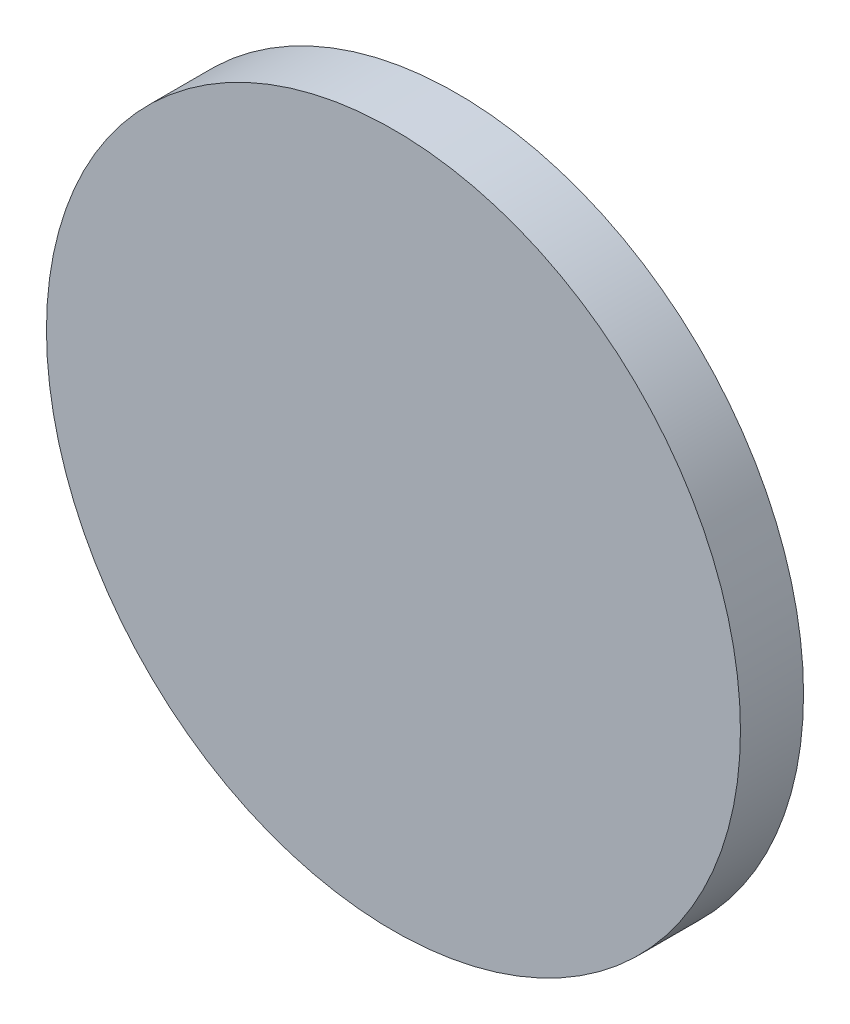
ISO-10303-21;
HEADER;
FILE_DESCRIPTION(('STEP AP214'),'2;1');
FILE_NAME('part.step','',(''),(''),'','','');
FILE_SCHEMA(('AUTOMOTIVE_DESIGN { 1 0 10303 214 1 1 1 1 }'));
ENDSEC;
DATA;
#1=APPLICATION_CONTEXT('core data for automotive mechanical design processes');
#2=APPLICATION_PROTOCOL_DEFINITION('international standard','automotive_design',2000,#1);
#3=PRODUCT_CONTEXT('',#1,'mechanical');
#4=PRODUCT('Part','Part','',(#3));
#5=PRODUCT_RELATED_PRODUCT_CATEGORY('part','',(#4));
#6=PRODUCT_DEFINITION_FORMATION('','',#4);
#7=PRODUCT_DEFINITION_CONTEXT('part definition',#1,'design');
#8=PRODUCT_DEFINITION('design','',#6,#7);
#9=PRODUCT_DEFINITION_SHAPE('','',#8);
#10=(LENGTH_UNIT() NAMED_UNIT(*) SI_UNIT(.MILLI.,.METRE.));
#11=(NAMED_UNIT(*) PLANE_ANGLE_UNIT() SI_UNIT($,.RADIAN.));
#12=(NAMED_UNIT(*) SI_UNIT($,.STERADIAN.) SOLID_ANGLE_UNIT());
#13=UNCERTAINTY_MEASURE_WITH_UNIT(LENGTH_MEASURE(1.E-05),#10,'distance_accuracy_value','');
#14=(GEOMETRIC_REPRESENTATION_CONTEXT(3) GLOBAL_UNCERTAINTY_ASSIGNED_CONTEXT((#13)) GLOBAL_UNIT_ASSIGNED_CONTEXT((#10,
#11,#12)) REPRESENTATION_CONTEXT('',''));
#15=CARTESIAN_POINT('',(0.,0.,0.));
#16=DIRECTION('',(0.,0.,1.));
#17=DIRECTION('',(1.,0.,0.));
#18=AXIS2_PLACEMENT_3D('',#15,#16,#17);
#19=CARTESIAN_POINT('',(0.,0.,49.6690475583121));
#20=DIRECTION('',(0.,0.,-1.));
#21=DIRECTION('',(-1.,0.,0.));
#22=AXIS2_PLACEMENT_3D('',#19,#20,#21);
#23=CYLINDRICAL_SURFACE('',#22,16.5);
#24=CARTESIAN_POINT('',(0.,0.,0.));
#25=DIRECTION('',(0.,0.,1.));
#26=DIRECTION('',(1.,0.,0.));
#27=AXIS2_PLACEMENT_3D('',#24,#25,#26);
#28=CIRCLE('',#27,16.5);
#29=CARTESIAN_POINT('',(16.5,0.,0.));
#30=VERTEX_POINT('',#29);
#31=EDGE_CURVE('E44',#30,#30,#28,.T.);
#32=ORIENTED_EDGE('',*,*,#31,.T.);
#33=EDGE_LOOP('',(#32));
#34=FACE_BOUND('',#33,.T.);
#35=CARTESIAN_POINT('',(0.,0.,3.));
#36=DIRECTION('',(0.,0.,1.));
#37=DIRECTION('',(1.,0.,0.));
#38=AXIS2_PLACEMENT_3D('',#35,#36,#37);
#39=CIRCLE('',#38,16.5);
#40=CARTESIAN_POINT('',(16.5,0.,3.));
#41=VERTEX_POINT('',#40);
#42=EDGE_CURVE('E10',#41,#41,#39,.T.);
#43=ORIENTED_EDGE('',*,*,#42,.F.);
#44=EDGE_LOOP('',(#43));
#45=FACE_BOUND('',#44,.T.);
#46=ADVANCED_FACE('F37',(#34,#45),#23,.T.);
#47=CARTESIAN_POINT('',(0.,0.,0.));
#48=DIRECTION('',(0.,0.,1.));
#49=DIRECTION('',(1.,0.,0.));
#50=AXIS2_PLACEMENT_3D('',#47,#48,#49);
#51=PLANE('',#50);
#52=ORIENTED_EDGE('',*,*,#31,.F.);
#53=EDGE_LOOP('',(#52));
#54=FACE_BOUND('',#53,.T.);
#55=ADVANCED_FACE('F52',(#54),#51,.F.);
#56=CARTESIAN_POINT('',(0.,0.,3.));
#57=DIRECTION('',(0.,0.,1.));
#58=DIRECTION('',(0.,1.,0.));
#59=AXIS2_PLACEMENT_3D('',#56,#57,#58);
#60=PLANE('',#59);
#61=ORIENTED_EDGE('',*,*,#42,.T.);
#62=EDGE_LOOP('',(#61));
#63=FACE_BOUND('',#62,.T.);
#64=ADVANCED_FACE('F39',(#63),#60,.T.);
#65=CLOSED_SHELL('',(#46,#55,#64));
#66=MANIFOLD_SOLID_BREP('B2',#65);
#67=ADVANCED_BREP_SHAPE_REPRESENTATION('',(#18,#66),#14);
#68=SHAPE_DEFINITION_REPRESENTATION(#9,#67);
ENDSEC;
END-ISO-10303-21;
